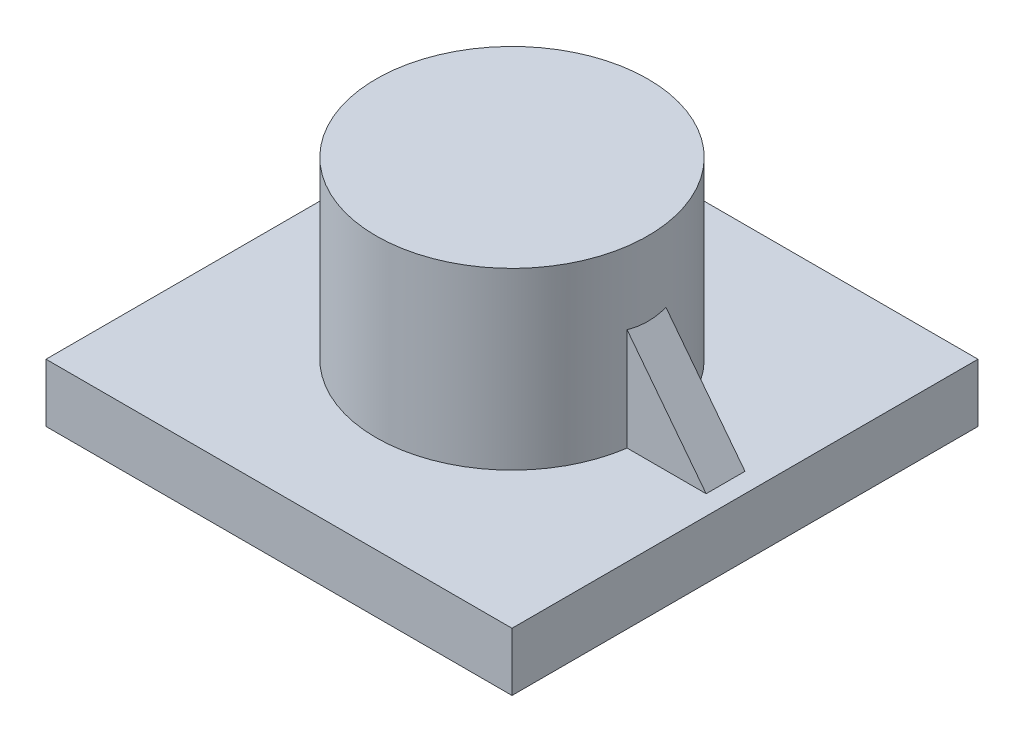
from build123d import *

# Parameters (mm, degrees)
SKETCH_1_W      = 120
SKETCH_1_H      = 120
EXTRUDE_1_DEPTH = 15
SKETCH_2_R      = 35
EXTRUDE_2_DEPTH = 60
EXTRUDE_3_DEPTH = 5


with BuildPart() as part:
    # Sketch 1 → Extrude 1 (new body)
    with BuildSketch(Plane(origin=(0, 0, 0), x_dir=(1, 0, 0), z_dir=(0, 1, 0))):
        Rectangle(SKETCH_1_W, SKETCH_1_H)
    extrude(amount=EXTRUDE_1_DEPTH)

    # Sketch 2 → Extrude 2 (add)
    with BuildSketch(Plane(origin=(0, 0, 0), x_dir=(1, 0, 0), z_dir=(0, 1, 0))):
        with Locations(Location((0, 0, 0), (0, 0, 270))):
            Circle(SKETCH_2_R)
    extrude(amount=EXTRUDE_2_DEPTH)

    # Sketch 3 → Extrude 3 (add, symmetric)
    with BuildSketch(Plane.XY):
        Polygon((28, 15), (55, 15), (28, 50), align=None)
    extrude(amount=EXTRUDE_3_DEPTH, both=True)


solid = part.part
